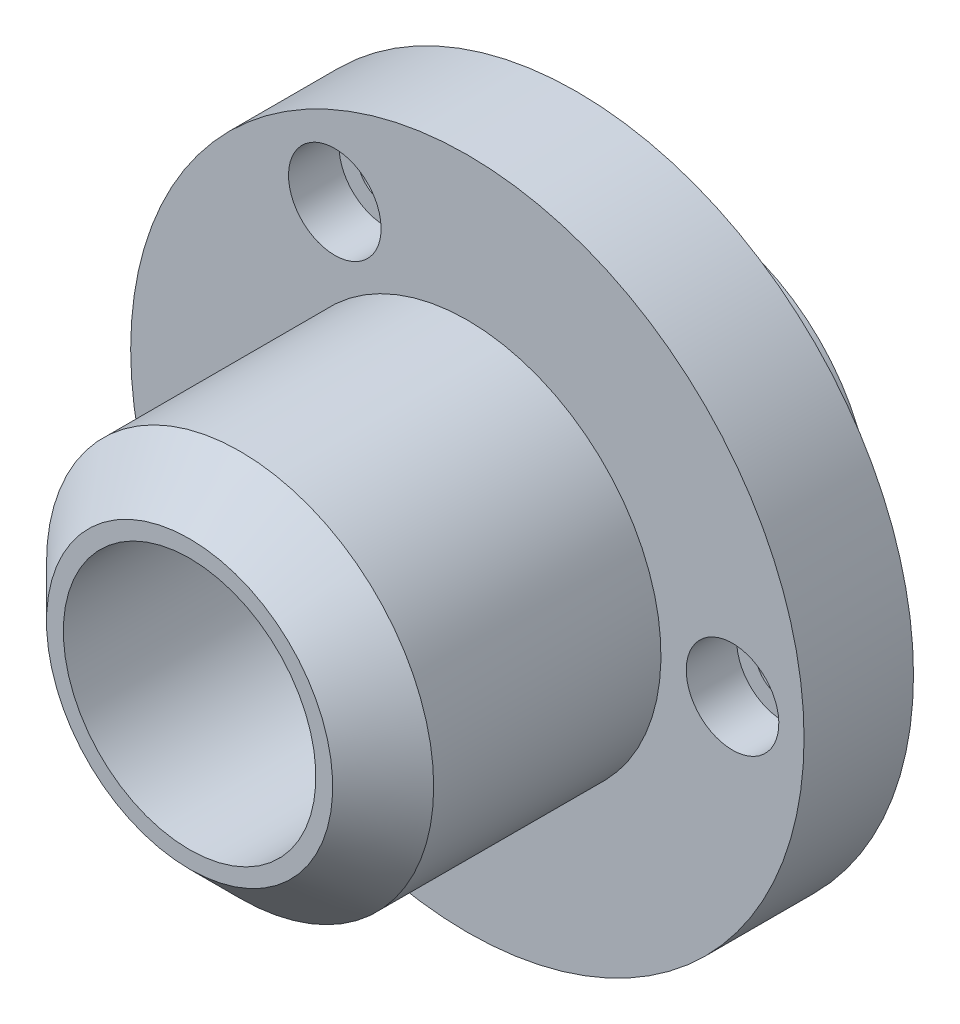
ISO-10303-21;
HEADER;
FILE_DESCRIPTION(('STEP AP214'),'2;1');
FILE_NAME('part.step','',(''),(''),'','','');
FILE_SCHEMA(('AUTOMOTIVE_DESIGN { 1 0 10303 214 1 1 1 1 }'));
ENDSEC;
DATA;
#1=APPLICATION_CONTEXT('core data for automotive mechanical design processes');
#2=APPLICATION_PROTOCOL_DEFINITION('international standard','automotive_design',2000,#1);
#3=PRODUCT_CONTEXT('',#1,'mechanical');
#4=PRODUCT('Part','Part','',(#3));
#5=PRODUCT_RELATED_PRODUCT_CATEGORY('part','',(#4));
#6=PRODUCT_DEFINITION_FORMATION('','',#4);
#7=PRODUCT_DEFINITION_CONTEXT('part definition',#1,'design');
#8=PRODUCT_DEFINITION('design','',#6,#7);
#9=PRODUCT_DEFINITION_SHAPE('','',#8);
#10=(LENGTH_UNIT() NAMED_UNIT(*) SI_UNIT(.MILLI.,.METRE.));
#11=(NAMED_UNIT(*) PLANE_ANGLE_UNIT() SI_UNIT($,.RADIAN.));
#12=(NAMED_UNIT(*) SI_UNIT($,.STERADIAN.) SOLID_ANGLE_UNIT());
#13=UNCERTAINTY_MEASURE_WITH_UNIT(LENGTH_MEASURE(1.E-05),#10,'distance_accuracy_value','');
#14=(GEOMETRIC_REPRESENTATION_CONTEXT(3) GLOBAL_UNCERTAINTY_ASSIGNED_CONTEXT((#13)) GLOBAL_UNIT_ASSIGNED_CONTEXT((#10,
#11,#12)) REPRESENTATION_CONTEXT('',''));
#15=CARTESIAN_POINT('',(0.,0.,0.));
#16=DIRECTION('',(0.,0.,1.));
#17=DIRECTION('',(1.,0.,0.));
#18=AXIS2_PLACEMENT_3D('',#15,#16,#17);
#19=CARTESIAN_POINT('',(0.,0.,0.));
#20=DIRECTION('',(0.,0.,-1.));
#21=DIRECTION('',(0.,1.,0.));
#22=AXIS2_PLACEMENT_3D('',#19,#20,#21);
#23=CYLINDRICAL_SURFACE('',#22,15.);
#24=CARTESIAN_POINT('',(0.,0.,46.));
#25=DIRECTION('',(0.,0.,-1.));
#26=DIRECTION('',(0.,1.,0.));
#27=AXIS2_PLACEMENT_3D('',#24,#25,#26);
#28=CIRCLE('',#27,15.);
#29=CARTESIAN_POINT('',(0.,15.,46.));
#30=VERTEX_POINT('',#29);
#31=EDGE_CURVE('E39',#30,#30,#28,.T.);
#32=ORIENTED_EDGE('',*,*,#31,.F.);
#33=EDGE_LOOP('',(#32));
#34=FACE_BOUND('',#33,.T.);
#35=CARTESIAN_POINT('',(0.,0.,1.));
#36=DIRECTION('',(0.,0.,-1.));
#37=DIRECTION('',(0.,1.,0.));
#38=AXIS2_PLACEMENT_3D('',#35,#36,#37);
#39=CIRCLE('',#38,15.);
#40=CARTESIAN_POINT('',(0.,15.,1.));
#41=VERTEX_POINT('',#40);
#42=EDGE_CURVE('E15',#41,#41,#39,.T.);
#43=ORIENTED_EDGE('',*,*,#42,.T.);
#44=EDGE_LOOP('',(#43));
#45=FACE_BOUND('',#44,.T.);
#46=ADVANCED_FACE('F12',(#34,#45),#23,.F.);
#47=CARTESIAN_POINT('',(0.,0.,0.));
#48=DIRECTION('',(0.,0.,-1.));
#49=DIRECTION('',(0.,1.,0.));
#50=AXIS2_PLACEMENT_3D('',#47,#48,#49);
#51=CYLINDRICAL_SURFACE('',#50,23.);
#52=CARTESIAN_POINT('',(0.,0.,40.));
#53=DIRECTION('',(0.,0.,1.));
#54=DIRECTION('',(0.,-1.,0.));
#55=AXIS2_PLACEMENT_3D('',#52,#53,#54);
#56=CIRCLE('',#55,23.);
#57=CARTESIAN_POINT('',(0.,-23.,40.));
#58=VERTEX_POINT('',#57);
#59=EDGE_CURVE('E19',#58,#58,#56,.F.);
#60=ORIENTED_EDGE('',*,*,#59,.T.);
#61=EDGE_LOOP('',(#60));
#62=FACE_BOUND('',#61,.T.);
#63=CARTESIAN_POINT('',(0.,0.,13.));
#64=DIRECTION('',(0.,0.,-1.));
#65=DIRECTION('',(0.,1.,0.));
#66=AXIS2_PLACEMENT_3D('',#63,#64,#65);
#67=CIRCLE('',#66,23.);
#68=CARTESIAN_POINT('',(0.,23.,13.));
#69=VERTEX_POINT('',#68);
#70=EDGE_CURVE('E52',#69,#69,#67,.T.);
#71=ORIENTED_EDGE('',*,*,#70,.F.);
#72=EDGE_LOOP('',(#71));
#73=FACE_BOUND('',#72,.T.);
#74=ADVANCED_FACE('F92',(#62,#73),#51,.T.);
#75=CARTESIAN_POINT('',(15.,0.,-14.));
#76=DIRECTION('',(0.,0.,-1.));
#77=DIRECTION('',(0.,1.,0.));
#78=AXIS2_PLACEMENT_3D('',#75,#76,#77);
#79=PLANE('',#78);
#80=CARTESIAN_POINT('',(0.,0.,-14.));
#81=DIRECTION('',(0.,0.,-1.));
#82=DIRECTION('',(0.,1.,0.));
#83=AXIS2_PLACEMENT_3D('',#80,#81,#82);
#84=CIRCLE('',#83,15.5);
#85=CARTESIAN_POINT('',(0.,15.5,-14.));
#86=VERTEX_POINT('',#85);
#87=EDGE_CURVE('E82',#86,#86,#84,.T.);
#88=ORIENTED_EDGE('',*,*,#87,.F.);
#89=EDGE_LOOP('',(#88));
#90=FACE_BOUND('',#89,.T.);
#91=CARTESIAN_POINT('',(0.,0.,-14.));
#92=DIRECTION('',(0.,0.,-1.));
#93=DIRECTION('',(0.,1.,0.));
#94=AXIS2_PLACEMENT_3D('',#91,#92,#93);
#95=CIRCLE('',#94,21.);
#96=CARTESIAN_POINT('',(0.,21.,-14.));
#97=VERTEX_POINT('',#96);
#98=EDGE_CURVE('E23',#97,#97,#95,.T.);
#99=ORIENTED_EDGE('',*,*,#98,.T.);
#100=EDGE_LOOP('',(#99));
#101=FACE_BOUND('',#100,.T.);
#102=ADVANCED_FACE('F88',(#90,#101),#79,.T.);
#103=CARTESIAN_POINT('',(0.,0.,0.));
#104=DIRECTION('',(0.,0.,-1.));
#105=DIRECTION('',(0.,1.,0.));
#106=AXIS2_PLACEMENT_3D('',#103,#104,#105);
#107=CYLINDRICAL_SURFACE('',#106,21.);
#108=CARTESIAN_POINT('',(0.,0.,0.));
#109=DIRECTION('',(0.,0.,-1.));
#110=DIRECTION('',(0.,1.,0.));
#111=AXIS2_PLACEMENT_3D('',#108,#109,#110);
#112=CIRCLE('',#111,21.);
#113=CARTESIAN_POINT('',(0.,21.,0.));
#114=VERTEX_POINT('',#113);
#115=EDGE_CURVE('E43',#114,#114,#112,.T.);
#116=ORIENTED_EDGE('',*,*,#115,.T.);
#117=EDGE_LOOP('',(#116));
#118=FACE_BOUND('',#117,.T.);
#119=ORIENTED_EDGE('',*,*,#98,.F.);
#120=EDGE_LOOP('',(#119));
#121=FACE_BOUND('',#120,.T.);
#122=ADVANCED_FACE('F91',(#118,#121),#107,.T.);
#123=CARTESIAN_POINT('',(21.,0.,0.));
#124=DIRECTION('',(0.,0.,-1.));
#125=DIRECTION('',(0.,1.,0.));
#126=AXIS2_PLACEMENT_3D('',#123,#124,#125);
#127=PLANE('',#126);
#128=CARTESIAN_POINT('',(-15.7499999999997,-27.2798002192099,0.));
#129=DIRECTION('',(0.,0.,-1.));
#130=DIRECTION('',(0.,1.,0.));
#131=AXIS2_PLACEMENT_3D('',#128,#129,#130);
#132=CIRCLE('',#131,3.3);
#133=CARTESIAN_POINT('',(-15.7499999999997,-23.9798002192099,0.));
#134=VERTEX_POINT('',#133);
#135=EDGE_CURVE('E26',#134,#134,#132,.T.);
#136=ORIENTED_EDGE('',*,*,#135,.F.);
#137=EDGE_LOOP('',(#136));
#138=FACE_BOUND('',#137,.T.);
#139=CARTESIAN_POINT('',(-15.75,27.2798002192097,0.));
#140=DIRECTION('',(0.,0.,-1.));
#141=DIRECTION('',(0.,1.,0.));
#142=AXIS2_PLACEMENT_3D('',#139,#140,#141);
#143=CIRCLE('',#142,3.3);
#144=CARTESIAN_POINT('',(-15.75,30.5798002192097,0.));
#145=VERTEX_POINT('',#144);
#146=EDGE_CURVE('E31',#145,#145,#143,.T.);
#147=ORIENTED_EDGE('',*,*,#146,.F.);
#148=EDGE_LOOP('',(#147));
#149=FACE_BOUND('',#148,.T.);
#150=CARTESIAN_POINT('',(31.5,0.,0.));
#151=DIRECTION('',(0.,0.,-1.));
#152=DIRECTION('',(0.,1.,0.));
#153=AXIS2_PLACEMENT_3D('',#150,#151,#152);
#154=CIRCLE('',#153,3.3);
#155=CARTESIAN_POINT('',(31.5,3.30000000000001,0.));
#156=VERTEX_POINT('',#155);
#157=EDGE_CURVE('E36',#156,#156,#154,.T.);
#158=ORIENTED_EDGE('',*,*,#157,.F.);
#159=EDGE_LOOP('',(#158));
#160=FACE_BOUND('',#159,.T.);
#161=CARTESIAN_POINT('',(0.,0.,0.));
#162=DIRECTION('',(0.,0.,-1.));
#163=DIRECTION('',(0.,1.,0.));
#164=AXIS2_PLACEMENT_3D('',#161,#162,#163);
#165=CIRCLE('',#164,40.);
#166=CARTESIAN_POINT('',(0.,40.,0.));
#167=VERTEX_POINT('',#166);
#168=EDGE_CURVE('E46',#167,#167,#165,.T.);
#169=ORIENTED_EDGE('',*,*,#168,.T.);
#170=EDGE_LOOP('',(#169));
#171=FACE_BOUND('',#170,.T.);
#172=ORIENTED_EDGE('',*,*,#115,.F.);
#173=EDGE_LOOP('',(#172));
#174=FACE_BOUND('',#173,.T.);
#175=ADVANCED_FACE('F96',(#138,#149,#160,#171,#174),#127,.T.);
#176=CARTESIAN_POINT('',(0.,0.,0.));
#177=DIRECTION('',(0.,0.,-1.));
#178=DIRECTION('',(0.,1.,0.));
#179=AXIS2_PLACEMENT_3D('',#176,#177,#178);
#180=CYLINDRICAL_SURFACE('',#179,40.);
#181=CARTESIAN_POINT('',(0.,0.,13.));
#182=DIRECTION('',(0.,0.,-1.));
#183=DIRECTION('',(0.,1.,0.));
#184=AXIS2_PLACEMENT_3D('',#181,#182,#183);
#185=CIRCLE('',#184,40.);
#186=CARTESIAN_POINT('',(0.,40.,13.));
#187=VERTEX_POINT('',#186);
#188=EDGE_CURVE('E49',#187,#187,#185,.T.);
#189=ORIENTED_EDGE('',*,*,#188,.T.);
#190=EDGE_LOOP('',(#189));
#191=FACE_BOUND('',#190,.T.);
#192=ORIENTED_EDGE('',*,*,#168,.F.);
#193=EDGE_LOOP('',(#192));
#194=FACE_BOUND('',#193,.T.);
#195=ADVANCED_FACE('F104',(#191,#194),#180,.T.);
#196=CARTESIAN_POINT('',(23.,0.,13.));
#197=DIRECTION('',(0.,0.,1.));
#198=DIRECTION('',(0.,-1.,0.));
#199=AXIS2_PLACEMENT_3D('',#196,#197,#198);
#200=PLANE('',#199);
#201=CARTESIAN_POINT('',(-15.7499999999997,-27.2798002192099,13.));
#202=DIRECTION('',(0.,0.,1.));
#203=DIRECTION('',(0.,-1.,0.));
#204=AXIS2_PLACEMENT_3D('',#201,#202,#203);
#205=CIRCLE('',#204,5.5);
#206=CARTESIAN_POINT('',(-15.7499999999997,-32.7798002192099,13.));
#207=VERTEX_POINT('',#206);
#208=EDGE_CURVE('E76',#207,#207,#205,.T.);
#209=ORIENTED_EDGE('',*,*,#208,.F.);
#210=EDGE_LOOP('',(#209));
#211=FACE_BOUND('',#210,.T.);
#212=CARTESIAN_POINT('',(-15.75,27.2798002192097,13.));
#213=DIRECTION('',(0.,0.,1.));
#214=DIRECTION('',(0.,-1.,0.));
#215=AXIS2_PLACEMENT_3D('',#212,#213,#214);
#216=CIRCLE('',#215,5.5);
#217=CARTESIAN_POINT('',(-15.75,21.7798002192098,13.));
#218=VERTEX_POINT('',#217);
#219=EDGE_CURVE('E29',#218,#218,#216,.T.);
#220=ORIENTED_EDGE('',*,*,#219,.F.);
#221=EDGE_LOOP('',(#220));
#222=FACE_BOUND('',#221,.T.);
#223=CARTESIAN_POINT('',(31.5,0.,13.));
#224=DIRECTION('',(0.,0.,1.));
#225=DIRECTION('',(0.,-1.,0.));
#226=AXIS2_PLACEMENT_3D('',#223,#224,#225);
#227=CIRCLE('',#226,5.5);
#228=CARTESIAN_POINT('',(31.5,-5.49999999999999,13.));
#229=VERTEX_POINT('',#228);
#230=EDGE_CURVE('E34',#229,#229,#227,.T.);
#231=ORIENTED_EDGE('',*,*,#230,.F.);
#232=EDGE_LOOP('',(#231));
#233=FACE_BOUND('',#232,.T.);
#234=ORIENTED_EDGE('',*,*,#70,.T.);
#235=EDGE_LOOP('',(#234));
#236=FACE_BOUND('',#235,.T.);
#237=ORIENTED_EDGE('',*,*,#188,.F.);
#238=EDGE_LOOP('',(#237));
#239=FACE_BOUND('',#238,.T.);
#240=ADVANCED_FACE('F174',(#211,#222,#233,#236,#239),#200,.T.);
#241=CARTESIAN_POINT('',(15.,0.,46.));
#242=DIRECTION('',(0.,0.,1.));
#243=DIRECTION('',(0.,-1.,0.));
#244=AXIS2_PLACEMENT_3D('',#241,#242,#243);
#245=PLANE('',#244);
#246=CARTESIAN_POINT('',(0.,0.,46.));
#247=DIRECTION('',(0.,0.,1.));
#248=DIRECTION('',(0.,-1.,0.));
#249=AXIS2_PLACEMENT_3D('',#246,#247,#248);
#250=CIRCLE('',#249,17.);
#251=CARTESIAN_POINT('',(0.,-17.,46.));
#252=VERTEX_POINT('',#251);
#253=EDGE_CURVE('E8',#252,#252,#250,.T.);
#254=ORIENTED_EDGE('',*,*,#253,.T.);
#255=EDGE_LOOP('',(#254));
#256=FACE_BOUND('',#255,.T.);
#257=ORIENTED_EDGE('',*,*,#31,.T.);
#258=EDGE_LOOP('',(#257));
#259=FACE_BOUND('',#258,.T.);
#260=ADVANCED_FACE('F171',(#256,#259),#245,.T.);
#261=CARTESIAN_POINT('',(31.5,0.,13.));
#262=DIRECTION('',(0.,0.,1.));
#263=DIRECTION('',(0.,-1.,0.));
#264=AXIS2_PLACEMENT_3D('',#261,#262,#263);
#265=CYLINDRICAL_SURFACE('',#264,3.3);
#266=ORIENTED_EDGE('',*,*,#157,.T.);
#267=EDGE_LOOP('',(#266));
#268=FACE_BOUND('',#267,.T.);
#269=CARTESIAN_POINT('',(31.5,0.,7.));
#270=DIRECTION('',(0.,0.,1.));
#271=DIRECTION('',(0.,-1.,0.));
#272=AXIS2_PLACEMENT_3D('',#269,#270,#271);
#273=CIRCLE('',#272,3.3);
#274=CARTESIAN_POINT('',(31.5,-3.29999999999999,7.));
#275=VERTEX_POINT('',#274);
#276=EDGE_CURVE('E40',#275,#275,#273,.T.);
#277=ORIENTED_EDGE('',*,*,#276,.T.);
#278=EDGE_LOOP('',(#277));
#279=FACE_BOUND('',#278,.T.);
#280=ADVANCED_FACE('F167',(#268,#279),#265,.F.);
#281=CARTESIAN_POINT('',(34.8,0.,7.));
#282=DIRECTION('',(0.,0.,-1.));
#283=DIRECTION('',(0.,1.,0.));
#284=AXIS2_PLACEMENT_3D('',#281,#282,#283);
#285=PLANE('',#284);
#286=ORIENTED_EDGE('',*,*,#276,.F.);
#287=EDGE_LOOP('',(#286));
#288=FACE_BOUND('',#287,.T.);
#289=CARTESIAN_POINT('',(31.5,0.,7.));
#290=DIRECTION('',(0.,0.,1.));
#291=DIRECTION('',(0.,-1.,0.));
#292=AXIS2_PLACEMENT_3D('',#289,#290,#291);
#293=CIRCLE('',#292,5.5);
#294=CARTESIAN_POINT('',(31.5,-5.49999999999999,7.));
#295=VERTEX_POINT('',#294);
#296=EDGE_CURVE('E59',#295,#295,#293,.T.);
#297=ORIENTED_EDGE('',*,*,#296,.T.);
#298=EDGE_LOOP('',(#297));
#299=FACE_BOUND('',#298,.T.);
#300=ADVANCED_FACE('F163',(#288,#299),#285,.F.);
#301=CARTESIAN_POINT('',(31.5,0.,13.));
#302=DIRECTION('',(0.,0.,1.));
#303=DIRECTION('',(0.,-1.,0.));
#304=AXIS2_PLACEMENT_3D('',#301,#302,#303);
#305=CYLINDRICAL_SURFACE('',#304,5.5);
#306=ORIENTED_EDGE('',*,*,#296,.F.);
#307=EDGE_LOOP('',(#306));
#308=FACE_BOUND('',#307,.T.);
#309=ORIENTED_EDGE('',*,*,#230,.T.);
#310=EDGE_LOOP('',(#309));
#311=FACE_BOUND('',#310,.T.);
#312=ADVANCED_FACE('F159',(#308,#311),#305,.F.);
#313=CARTESIAN_POINT('',(-15.75,27.2798002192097,13.));
#314=DIRECTION('',(0.,0.,1.));
#315=DIRECTION('',(0.,-1.,0.));
#316=AXIS2_PLACEMENT_3D('',#313,#314,#315);
#317=CYLINDRICAL_SURFACE('',#316,3.3);
#318=ORIENTED_EDGE('',*,*,#146,.T.);
#319=EDGE_LOOP('',(#318));
#320=FACE_BOUND('',#319,.T.);
#321=CARTESIAN_POINT('',(-15.75,27.2798002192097,7.));
#322=DIRECTION('',(0.,0.,1.));
#323=DIRECTION('',(0.,-1.,0.));
#324=AXIS2_PLACEMENT_3D('',#321,#322,#323);
#325=CIRCLE('',#324,3.3);
#326=CARTESIAN_POINT('',(-15.75,23.9798002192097,7.));
#327=VERTEX_POINT('',#326);
#328=EDGE_CURVE('E35',#327,#327,#325,.T.);
#329=ORIENTED_EDGE('',*,*,#328,.T.);
#330=EDGE_LOOP('',(#329));
#331=FACE_BOUND('',#330,.T.);
#332=ADVANCED_FACE('F155',(#320,#331),#317,.F.);
#333=CARTESIAN_POINT('',(-12.4500000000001,27.2798002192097,7.));
#334=DIRECTION('',(0.,0.,-1.));
#335=DIRECTION('',(0.,1.,0.));
#336=AXIS2_PLACEMENT_3D('',#333,#334,#335);
#337=PLANE('',#336);
#338=ORIENTED_EDGE('',*,*,#328,.F.);
#339=EDGE_LOOP('',(#338));
#340=FACE_BOUND('',#339,.T.);
#341=CARTESIAN_POINT('',(-15.75,27.2798002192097,7.));
#342=DIRECTION('',(0.,0.,1.));
#343=DIRECTION('',(0.,-1.,0.));
#344=AXIS2_PLACEMENT_3D('',#341,#342,#343);
#345=CIRCLE('',#344,5.5);
#346=CARTESIAN_POINT('',(-15.75,21.7798002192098,7.));
#347=VERTEX_POINT('',#346);
#348=EDGE_CURVE('E66',#347,#347,#345,.T.);
#349=ORIENTED_EDGE('',*,*,#348,.T.);
#350=EDGE_LOOP('',(#349));
#351=FACE_BOUND('',#350,.T.);
#352=ADVANCED_FACE('F151',(#340,#351),#337,.F.);
#353=CARTESIAN_POINT('',(-15.75,27.2798002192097,13.));
#354=DIRECTION('',(0.,0.,1.));
#355=DIRECTION('',(0.,-1.,0.));
#356=AXIS2_PLACEMENT_3D('',#353,#354,#355);
#357=CYLINDRICAL_SURFACE('',#356,5.5);
#358=ORIENTED_EDGE('',*,*,#348,.F.);
#359=EDGE_LOOP('',(#358));
#360=FACE_BOUND('',#359,.T.);
#361=ORIENTED_EDGE('',*,*,#219,.T.);
#362=EDGE_LOOP('',(#361));
#363=FACE_BOUND('',#362,.T.);
#364=ADVANCED_FACE('F147',(#360,#363),#357,.F.);
#365=CARTESIAN_POINT('',(-15.7499999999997,-27.2798002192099,13.));
#366=DIRECTION('',(0.,0.,1.));
#367=DIRECTION('',(0.,-1.,0.));
#368=AXIS2_PLACEMENT_3D('',#365,#366,#367);
#369=CYLINDRICAL_SURFACE('',#368,3.3);
#370=ORIENTED_EDGE('',*,*,#135,.T.);
#371=EDGE_LOOP('',(#370));
#372=FACE_BOUND('',#371,.T.);
#373=CARTESIAN_POINT('',(-15.7499999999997,-27.2798002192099,7.));
#374=DIRECTION('',(0.,0.,1.));
#375=DIRECTION('',(0.,-1.,0.));
#376=AXIS2_PLACEMENT_3D('',#373,#374,#375);
#377=CIRCLE('',#376,3.3);
#378=CARTESIAN_POINT('',(-15.7499999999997,-30.57980021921,7.));
#379=VERTEX_POINT('',#378);
#380=EDGE_CURVE('E30',#379,#379,#377,.T.);
#381=ORIENTED_EDGE('',*,*,#380,.T.);
#382=EDGE_LOOP('',(#381));
#383=FACE_BOUND('',#382,.T.);
#384=ADVANCED_FACE('F143',(#372,#383),#369,.F.);
#385=CARTESIAN_POINT('',(-12.4499999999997,-27.2798002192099,7.));
#386=DIRECTION('',(0.,0.,-1.));
#387=DIRECTION('',(0.,1.,0.));
#388=AXIS2_PLACEMENT_3D('',#385,#386,#387);
#389=PLANE('',#388);
#390=ORIENTED_EDGE('',*,*,#380,.F.);
#391=EDGE_LOOP('',(#390));
#392=FACE_BOUND('',#391,.T.);
#393=CARTESIAN_POINT('',(-15.7499999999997,-27.2798002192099,7.));
#394=DIRECTION('',(0.,0.,1.));
#395=DIRECTION('',(0.,-1.,0.));
#396=AXIS2_PLACEMENT_3D('',#393,#394,#395);
#397=CIRCLE('',#396,5.5);
#398=CARTESIAN_POINT('',(-15.7499999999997,-32.7798002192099,7.));
#399=VERTEX_POINT('',#398);
#400=EDGE_CURVE('E73',#399,#399,#397,.T.);
#401=ORIENTED_EDGE('',*,*,#400,.T.);
#402=EDGE_LOOP('',(#401));
#403=FACE_BOUND('',#402,.T.);
#404=ADVANCED_FACE('F139',(#392,#403),#389,.F.);
#405=CARTESIAN_POINT('',(-15.7499999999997,-27.2798002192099,13.));
#406=DIRECTION('',(0.,0.,1.));
#407=DIRECTION('',(0.,-1.,0.));
#408=AXIS2_PLACEMENT_3D('',#405,#406,#407);
#409=CYLINDRICAL_SURFACE('',#408,5.5);
#410=ORIENTED_EDGE('',*,*,#400,.F.);
#411=EDGE_LOOP('',(#410));
#412=FACE_BOUND('',#411,.T.);
#413=ORIENTED_EDGE('',*,*,#208,.T.);
#414=EDGE_LOOP('',(#413));
#415=FACE_BOUND('',#414,.T.);
#416=ADVANCED_FACE('F133',(#412,#415),#409,.F.);
#417=CARTESIAN_POINT('',(0.,0.,40.));
#418=DIRECTION('',(0.,0.,-1.));
#419=DIRECTION('',(0.,1.,0.));
#420=AXIS2_PLACEMENT_3D('',#417,#418,#419);
#421=CONICAL_SURFACE('',#420,23.,0.785398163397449);
#422=ORIENTED_EDGE('',*,*,#253,.F.);
#423=EDGE_LOOP('',(#422));
#424=FACE_BOUND('',#423,.T.);
#425=ORIENTED_EDGE('',*,*,#59,.F.);
#426=EDGE_LOOP('',(#425));
#427=FACE_BOUND('',#426,.T.);
#428=ADVANCED_FACE('F127',(#424,#427),#421,.T.);
#429=CARTESIAN_POINT('',(0.,0.,1.));
#430=DIRECTION('',(0.,0.,-1.));
#431=DIRECTION('',(0.,1.,0.));
#432=AXIS2_PLACEMENT_3D('',#429,#430,#431);
#433=CYLINDRICAL_SURFACE('',#432,15.5);
#434=CARTESIAN_POINT('',(0.,0.,1.));
#435=DIRECTION('',(0.,0.,-1.));
#436=DIRECTION('',(0.,1.,0.));
#437=AXIS2_PLACEMENT_3D('',#434,#435,#436);
#438=CIRCLE('',#437,15.5);
#439=CARTESIAN_POINT('',(0.,15.5,1.));
#440=VERTEX_POINT('',#439);
#441=EDGE_CURVE('E79',#440,#440,#438,.T.);
#442=ORIENTED_EDGE('',*,*,#441,.F.);
#443=EDGE_LOOP('',(#442));
#444=FACE_BOUND('',#443,.T.);
#445=ORIENTED_EDGE('',*,*,#87,.T.);
#446=EDGE_LOOP('',(#445));
#447=FACE_BOUND('',#446,.T.);
#448=ADVANCED_FACE('F86',(#444,#447),#433,.F.);
#449=CARTESIAN_POINT('',(0.,0.,1.));
#450=DIRECTION('',(0.,0.,-1.));
#451=DIRECTION('',(0.,1.,0.));
#452=AXIS2_PLACEMENT_3D('',#449,#450,#451);
#453=PLANE('',#452);
#454=ORIENTED_EDGE('',*,*,#42,.F.);
#455=EDGE_LOOP('',(#454));
#456=FACE_BOUND('',#455,.T.);
#457=ORIENTED_EDGE('',*,*,#441,.T.);
#458=EDGE_LOOP('',(#457));
#459=FACE_BOUND('',#458,.T.);
#460=ADVANCED_FACE('F120',(#456,#459),#453,.T.);
#461=CLOSED_SHELL('',(#46,#74,#102,#122,#175,#195,#240,#260,#280,#300,#312,#332,#352,#364,#384,
#404,#416,#428,#448,#460));
#462=MANIFOLD_SOLID_BREP('B1',#461);
#463=ADVANCED_BREP_SHAPE_REPRESENTATION('',(#18,#462),#14);
#464=SHAPE_DEFINITION_REPRESENTATION(#9,#463);
ENDSEC;
END-ISO-10303-21;
